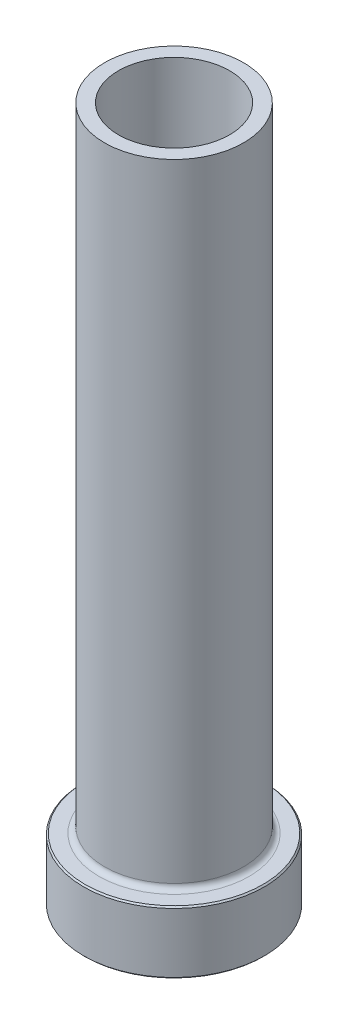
ISO-10303-21;
HEADER;
FILE_DESCRIPTION(('STEP AP214'),'2;1');
FILE_NAME('part.step','',(''),(''),'','','');
FILE_SCHEMA(('AUTOMOTIVE_DESIGN { 1 0 10303 214 1 1 1 1 }'));
ENDSEC;
DATA;
#1=APPLICATION_CONTEXT('core data for automotive mechanical design processes');
#2=APPLICATION_PROTOCOL_DEFINITION('international standard','automotive_design',2000,#1);
#3=PRODUCT_CONTEXT('',#1,'mechanical');
#4=PRODUCT('Part','Part','',(#3));
#5=PRODUCT_RELATED_PRODUCT_CATEGORY('part','',(#4));
#6=PRODUCT_DEFINITION_FORMATION('','',#4);
#7=PRODUCT_DEFINITION_CONTEXT('part definition',#1,'design');
#8=PRODUCT_DEFINITION('design','',#6,#7);
#9=PRODUCT_DEFINITION_SHAPE('','',#8);
#10=(LENGTH_UNIT() NAMED_UNIT(*) SI_UNIT(.MILLI.,.METRE.));
#11=(NAMED_UNIT(*) PLANE_ANGLE_UNIT() SI_UNIT($,.RADIAN.));
#12=(NAMED_UNIT(*) SI_UNIT($,.STERADIAN.) SOLID_ANGLE_UNIT());
#13=UNCERTAINTY_MEASURE_WITH_UNIT(LENGTH_MEASURE(1.E-05),#10,'distance_accuracy_value','');
#14=(GEOMETRIC_REPRESENTATION_CONTEXT(3) GLOBAL_UNCERTAINTY_ASSIGNED_CONTEXT((#13)) GLOBAL_UNIT_ASSIGNED_CONTEXT((#10,
#11,#12)) REPRESENTATION_CONTEXT('',''));
#15=CARTESIAN_POINT('',(0.,0.,0.));
#16=DIRECTION('',(0.,0.,1.));
#17=DIRECTION('',(1.,0.,0.));
#18=AXIS2_PLACEMENT_3D('',#15,#16,#17);
#19=CARTESIAN_POINT('',(0.,92.1876809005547,0.));
#20=DIRECTION('',(0.,1.,0.));
#21=DIRECTION('',(0.,0.,1.));
#22=AXIS2_PLACEMENT_3D('',#19,#20,#21);
#23=CYLINDRICAL_SURFACE('',#22,8.00000000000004);
#24=CARTESIAN_POINT('',(0.,100.,0.));
#25=DIRECTION('',(0.,1.,0.));
#26=DIRECTION('',(0.,0.,1.));
#27=AXIS2_PLACEMENT_3D('',#24,#25,#26);
#28=CIRCLE('',#27,8.00000000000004);
#29=CARTESIAN_POINT('',(0.,100.,8.00000000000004));
#30=VERTEX_POINT('',#29);
#31=EDGE_CURVE('E62',#30,#30,#28,.T.);
#32=ORIENTED_EDGE('',*,*,#31,.T.);
#33=EDGE_LOOP('',(#32));
#34=FACE_BOUND('',#33,.T.);
#35=CARTESIAN_POINT('',(0.,45.,0.));
#36=DIRECTION('',(0.,1.,0.));
#37=DIRECTION('',(0.,0.,1.));
#38=AXIS2_PLACEMENT_3D('',#35,#36,#37);
#39=CIRCLE('',#38,8.00000000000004);
#40=CARTESIAN_POINT('',(0.,45.,8.00000000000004));
#41=VERTEX_POINT('',#40);
#42=EDGE_CURVE('E71',#41,#41,#39,.T.);
#43=ORIENTED_EDGE('',*,*,#42,.F.);
#44=EDGE_LOOP('',(#43));
#45=FACE_BOUND('',#44,.T.);
#46=ADVANCED_FACE('F30',(#34,#45),#23,.F.);
#47=CARTESIAN_POINT('',(-8.00000000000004,100.,0.));
#48=DIRECTION('',(0.,1.,0.));
#49=DIRECTION('',(0.,0.,1.));
#50=AXIS2_PLACEMENT_3D('',#47,#48,#49);
#51=PLANE('',#50);
#52=CARTESIAN_POINT('',(0.,100.,0.));
#53=DIRECTION('',(0.,1.,0.));
#54=DIRECTION('',(0.,0.,1.));
#55=AXIS2_PLACEMENT_3D('',#52,#53,#54);
#56=CIRCLE('',#55,10.);
#57=CARTESIAN_POINT('',(0.,100.,10.));
#58=VERTEX_POINT('',#57);
#59=EDGE_CURVE('E65',#58,#58,#56,.T.);
#60=ORIENTED_EDGE('',*,*,#59,.T.);
#61=EDGE_LOOP('',(#60));
#62=FACE_BOUND('',#61,.T.);
#63=ORIENTED_EDGE('',*,*,#31,.F.);
#64=EDGE_LOOP('',(#63));
#65=FACE_BOUND('',#64,.T.);
#66=ADVANCED_FACE('F79',(#62,#65),#51,.T.);
#67=CARTESIAN_POINT('',(0.,92.1876809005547,0.));
#68=DIRECTION('',(0.,1.,0.));
#69=DIRECTION('',(0.,0.,1.));
#70=AXIS2_PLACEMENT_3D('',#67,#68,#69);
#71=CYLINDRICAL_SURFACE('',#70,9.99999999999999);
#72=CARTESIAN_POINT('',(0.,9.8,0.));
#73=DIRECTION('',(0.,1.,0.));
#74=DIRECTION('',(0.,0.,1.));
#75=AXIS2_PLACEMENT_3D('',#72,#73,#74);
#76=CIRCLE('',#75,9.99999999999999);
#77=CARTESIAN_POINT('',(0.,9.8,9.99999999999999));
#78=VERTEX_POINT('',#77);
#79=EDGE_CURVE('E59',#78,#78,#76,.T.);
#80=ORIENTED_EDGE('',*,*,#79,.T.);
#81=EDGE_LOOP('',(#80));
#82=FACE_BOUND('',#81,.T.);
#83=ORIENTED_EDGE('',*,*,#59,.F.);
#84=EDGE_LOOP('',(#83));
#85=FACE_BOUND('',#84,.T.);
#86=ADVANCED_FACE('F85',(#82,#85),#71,.T.);
#87=CARTESIAN_POINT('',(-9.99999999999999,9.,0.));
#88=DIRECTION('',(0.,1.,0.));
#89=DIRECTION('',(0.,0.,1.));
#90=AXIS2_PLACEMENT_3D('',#87,#88,#89);
#91=PLANE('',#90);
#92=CARTESIAN_POINT('',(0.,9.,0.));
#93=DIRECTION('',(0.,1.,0.));
#94=DIRECTION('',(0.,0.,1.));
#95=AXIS2_PLACEMENT_3D('',#92,#93,#94);
#96=CIRCLE('',#95,12.8);
#97=CARTESIAN_POINT('',(0.,9.,12.8));
#98=VERTEX_POINT('',#97);
#99=EDGE_CURVE('E53',#98,#98,#96,.T.);
#100=ORIENTED_EDGE('',*,*,#99,.T.);
#101=EDGE_LOOP('',(#100));
#102=FACE_BOUND('',#101,.T.);
#103=CARTESIAN_POINT('',(0.,9.,0.));
#104=DIRECTION('',(0.,1.,0.));
#105=DIRECTION('',(0.,0.,1.));
#106=AXIS2_PLACEMENT_3D('',#103,#104,#105);
#107=CIRCLE('',#106,10.8);
#108=CARTESIAN_POINT('',(0.,9.,10.8));
#109=VERTEX_POINT('',#108);
#110=EDGE_CURVE('E56',#109,#109,#107,.F.);
#111=ORIENTED_EDGE('',*,*,#110,.T.);
#112=EDGE_LOOP('',(#111));
#113=FACE_BOUND('',#112,.T.);
#114=ADVANCED_FACE('F111',(#102,#113),#91,.T.);
#115=CARTESIAN_POINT('',(0.,92.1876809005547,0.));
#116=DIRECTION('',(0.,1.,0.));
#117=DIRECTION('',(0.,0.,1.));
#118=AXIS2_PLACEMENT_3D('',#115,#116,#117);
#119=CYLINDRICAL_SURFACE('',#118,13.);
#120=CARTESIAN_POINT('',(0.,8.8,0.));
#121=DIRECTION('',(0.,1.,0.));
#122=DIRECTION('',(0.,0.,1.));
#123=AXIS2_PLACEMENT_3D('',#120,#121,#122);
#124=CIRCLE('',#123,13.);
#125=CARTESIAN_POINT('',(0.,8.8,13.));
#126=VERTEX_POINT('',#125);
#127=EDGE_CURVE('E45',#126,#126,#124,.F.);
#128=ORIENTED_EDGE('',*,*,#127,.T.);
#129=EDGE_LOOP('',(#128));
#130=FACE_BOUND('',#129,.T.);
#131=CARTESIAN_POINT('',(0.,0.199999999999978,0.));
#132=DIRECTION('',(0.,-1.,0.));
#133=DIRECTION('',(0.,0.,-1.));
#134=AXIS2_PLACEMENT_3D('',#131,#132,#133);
#135=CIRCLE('',#134,13.);
#136=CARTESIAN_POINT('',(0.,0.199999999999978,13.));
#137=VERTEX_POINT('',#136);
#138=EDGE_CURVE('E50',#137,#137,#135,.F.);
#139=ORIENTED_EDGE('',*,*,#138,.T.);
#140=EDGE_LOOP('',(#139));
#141=FACE_BOUND('',#140,.T.);
#142=ADVANCED_FACE('F108',(#130,#141),#119,.T.);
#143=CARTESIAN_POINT('',(-13.,0.,0.));
#144=DIRECTION('',(0.,-1.,0.));
#145=DIRECTION('',(0.,0.,-1.));
#146=AXIS2_PLACEMENT_3D('',#143,#144,#145);
#147=PLANE('',#146);
#148=CARTESIAN_POINT('',(0.,0.,0.));
#149=DIRECTION('',(0.,-1.,0.));
#150=DIRECTION('',(0.,0.,-1.));
#151=AXIS2_PLACEMENT_3D('',#148,#149,#150);
#152=CIRCLE('',#151,8.74999999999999);
#153=CARTESIAN_POINT('',(0.,0.,-8.74999999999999));
#154=VERTEX_POINT('',#153);
#155=EDGE_CURVE('E37',#154,#154,#152,.F.);
#156=ORIENTED_EDGE('',*,*,#155,.T.);
#157=EDGE_LOOP('',(#156));
#158=FACE_BOUND('',#157,.T.);
#159=CARTESIAN_POINT('',(0.,0.,0.));
#160=DIRECTION('',(0.,-1.,0.));
#161=DIRECTION('',(0.,0.,-1.));
#162=AXIS2_PLACEMENT_3D('',#159,#160,#161);
#163=CIRCLE('',#162,12.8);
#164=CARTESIAN_POINT('',(0.,0.,12.8));
#165=VERTEX_POINT('',#164);
#166=EDGE_CURVE('E41',#165,#165,#163,.T.);
#167=ORIENTED_EDGE('',*,*,#166,.T.);
#168=EDGE_LOOP('',(#167));
#169=FACE_BOUND('',#168,.T.);
#170=ADVANCED_FACE('F110',(#158,#169),#147,.T.);
#171=CARTESIAN_POINT('',(0.,92.1876809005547,0.));
#172=DIRECTION('',(0.,1.,0.));
#173=DIRECTION('',(0.,0.,1.));
#174=AXIS2_PLACEMENT_3D('',#171,#172,#173);
#175=CYLINDRICAL_SURFACE('',#174,8.24999999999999);
#176=CARTESIAN_POINT('',(0.,0.5,0.));
#177=DIRECTION('',(0.,-1.,0.));
#178=DIRECTION('',(0.,0.,-1.));
#179=AXIS2_PLACEMENT_3D('',#176,#177,#178);
#180=CIRCLE('',#179,8.24999999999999);
#181=CARTESIAN_POINT('',(0.,0.5,-8.24999999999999));
#182=VERTEX_POINT('',#181);
#183=EDGE_CURVE('E10',#182,#182,#180,.T.);
#184=ORIENTED_EDGE('',*,*,#183,.T.);
#185=EDGE_LOOP('',(#184));
#186=FACE_BOUND('',#185,.T.);
#187=CARTESIAN_POINT('',(0.,33.,0.));
#188=DIRECTION('',(0.,1.,0.));
#189=DIRECTION('',(0.,0.,1.));
#190=AXIS2_PLACEMENT_3D('',#187,#188,#189);
#191=CIRCLE('',#190,8.24999999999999);
#192=CARTESIAN_POINT('',(0.,33.,8.24999999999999));
#193=VERTEX_POINT('',#192);
#194=EDGE_CURVE('E68',#193,#193,#191,.T.);
#195=ORIENTED_EDGE('',*,*,#194,.T.);
#196=EDGE_LOOP('',(#195));
#197=FACE_BOUND('',#196,.T.);
#198=ADVANCED_FACE('F118',(#186,#197),#175,.F.);
#199=CARTESIAN_POINT('',(0.,33.,0.));
#200=DIRECTION('',(0.,-1.,0.));
#201=DIRECTION('',(0.,0.,-1.));
#202=AXIS2_PLACEMENT_3D('',#199,#200,#201);
#203=CONICAL_SURFACE('',#202,8.24999999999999,0.0208303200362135);
#204=ORIENTED_EDGE('',*,*,#42,.T.);
#205=EDGE_LOOP('',(#204));
#206=FACE_BOUND('',#205,.T.);
#207=ORIENTED_EDGE('',*,*,#194,.F.);
#208=EDGE_LOOP('',(#207));
#209=FACE_BOUND('',#208,.T.);
#210=ADVANCED_FACE('F75',(#206,#209),#203,.F.);
#211=CARTESIAN_POINT('',(0.,9.8,0.));
#212=DIRECTION('',(0.,1.,0.));
#213=DIRECTION('',(0.,0.,1.));
#214=AXIS2_PLACEMENT_3D('',#211,#212,#213);
#215=TOROIDAL_SURFACE('',#214,10.8,0.8);
#216=ORIENTED_EDGE('',*,*,#110,.F.);
#217=EDGE_LOOP('',(#216));
#218=FACE_BOUND('',#217,.T.);
#219=ORIENTED_EDGE('',*,*,#79,.F.);
#220=EDGE_LOOP('',(#219));
#221=FACE_BOUND('',#220,.T.);
#222=ADVANCED_FACE('F90',(#218,#221),#215,.F.);
#223=CARTESIAN_POINT('',(0.,8.99999999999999,0.));
#224=DIRECTION('',(0.,-1.,0.));
#225=DIRECTION('',(0.,0.,-1.));
#226=AXIS2_PLACEMENT_3D('',#223,#224,#225);
#227=CONICAL_SURFACE('',#226,12.8,0.785398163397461);
#228=ORIENTED_EDGE('',*,*,#127,.F.);
#229=EDGE_LOOP('',(#228));
#230=FACE_BOUND('',#229,.T.);
#231=ORIENTED_EDGE('',*,*,#99,.F.);
#232=EDGE_LOOP('',(#231));
#233=FACE_BOUND('',#232,.T.);
#234=ADVANCED_FACE('F93',(#230,#233),#227,.T.);
#235=CARTESIAN_POINT('',(0.,0.199999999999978,0.));
#236=DIRECTION('',(0.,1.,0.));
#237=DIRECTION('',(0.,0.,1.));
#238=AXIS2_PLACEMENT_3D('',#235,#236,#237);
#239=CONICAL_SURFACE('',#238,13.,0.785398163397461);
#240=CARTESIAN_POINT('',(0.,0.,12.8));
#241=CARTESIAN_POINT('',(0.,0.00208333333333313,12.8020833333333));
#242=CARTESIAN_POINT('',(0.,0.00416666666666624,12.8041666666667));
#243=CARTESIAN_POINT('',(0.,0.00833333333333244,12.8083333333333));
#244=CARTESIAN_POINT('',(0.,0.0104166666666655,12.8104166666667));
#245=CARTESIAN_POINT('',(0.,0.0145833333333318,12.8145833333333));
#246=CARTESIAN_POINT('',(0.,0.0166666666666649,12.8166666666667));
#247=CARTESIAN_POINT('',(0.,0.0208333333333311,12.8208333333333));
#248=CARTESIAN_POINT('',(0.,0.0229166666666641,12.8229166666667));
#249=CARTESIAN_POINT('',(0.,0.0270833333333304,12.8270833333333));
#250=CARTESIAN_POINT('',(0.,0.0291666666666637,12.8291666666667));
#251=CARTESIAN_POINT('',(0.,0.0333333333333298,12.8333333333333));
#252=CARTESIAN_POINT('',(0.,0.0354166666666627,12.8354166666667));
#253=CARTESIAN_POINT('',(0.,0.0395833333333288,12.8395833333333));
#254=CARTESIAN_POINT('',(0.,0.0416666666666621,12.8416666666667));
#255=CARTESIAN_POINT('',(0.,0.0458333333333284,12.8458333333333));
#256=CARTESIAN_POINT('',(0.,0.0479166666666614,12.8479166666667));
#257=CARTESIAN_POINT('',(0.,0.0520833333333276,12.8520833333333));
#258=CARTESIAN_POINT('',(0.,0.0541666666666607,12.8541666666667));
#259=CARTESIAN_POINT('',(0.,0.0583333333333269,12.8583333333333));
#260=CARTESIAN_POINT('',(0.,0.06041666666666,12.8604166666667));
#261=CARTESIAN_POINT('',(0.,0.0645833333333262,12.8645833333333));
#262=CARTESIAN_POINT('',(0.,0.0666666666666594,12.8666666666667));
#263=CARTESIAN_POINT('',(0.,0.0708333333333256,12.8708333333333));
#264=CARTESIAN_POINT('',(0.,0.0729166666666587,12.8729166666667));
#265=CARTESIAN_POINT('',(0.,0.0770833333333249,12.8770833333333));
#266=CARTESIAN_POINT('',(0.,0.079166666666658,12.8791666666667));
#267=CARTESIAN_POINT('',(0.,0.0833333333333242,12.8833333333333));
#268=CARTESIAN_POINT('',(0.,0.0854166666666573,12.8854166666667));
#269=CARTESIAN_POINT('',(0.,0.0895833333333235,12.8895833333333));
#270=CARTESIAN_POINT('',(0.,0.0916666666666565,12.8916666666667));
#271=CARTESIAN_POINT('',(0.,0.0958333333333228,12.8958333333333));
#272=CARTESIAN_POINT('',(0.,0.0979166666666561,12.8979166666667));
#273=CARTESIAN_POINT('',(0.,0.102083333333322,12.9020833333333));
#274=CARTESIAN_POINT('',(0.,0.104166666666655,12.9041666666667));
#275=CARTESIAN_POINT('',(0.,0.108333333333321,12.9083333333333));
#276=CARTESIAN_POINT('',(0.,0.110416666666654,12.9104166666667));
#277=CARTESIAN_POINT('',(0.,0.114583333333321,12.9145833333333));
#278=CARTESIAN_POINT('',(0.,0.116666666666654,12.9166666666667));
#279=CARTESIAN_POINT('',(0.,0.12083333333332,12.9208333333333));
#280=CARTESIAN_POINT('',(0.,0.122916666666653,12.9229166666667));
#281=CARTESIAN_POINT('',(0.,0.127083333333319,12.9270833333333));
#282=CARTESIAN_POINT('',(0.,0.129166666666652,12.9291666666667));
#283=CARTESIAN_POINT('',(0.,0.133333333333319,12.9333333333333));
#284=CARTESIAN_POINT('',(0.,0.135416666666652,12.9354166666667));
#285=CARTESIAN_POINT('',(0.,0.139583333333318,12.9395833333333));
#286=CARTESIAN_POINT('',(0.,0.141666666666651,12.9416666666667));
#287=CARTESIAN_POINT('',(0.,0.145833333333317,12.9458333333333));
#288=CARTESIAN_POINT('',(0.,0.14791666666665,12.9479166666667));
#289=CARTESIAN_POINT('',(0.,0.152083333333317,12.9520833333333));
#290=CARTESIAN_POINT('',(0.,0.15416666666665,12.9541666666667));
#291=CARTESIAN_POINT('',(0.,0.158333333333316,12.9583333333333));
#292=CARTESIAN_POINT('',(0.,0.160416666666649,12.9604166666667));
#293=CARTESIAN_POINT('',(0.,0.164583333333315,12.9645833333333));
#294=CARTESIAN_POINT('',(0.,0.166666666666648,12.9666666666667));
#295=CARTESIAN_POINT('',(0.,0.170833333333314,12.9708333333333));
#296=CARTESIAN_POINT('',(0.,0.172916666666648,12.9729166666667));
#297=CARTESIAN_POINT('',(0.,0.177083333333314,12.9770833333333));
#298=CARTESIAN_POINT('',(0.,0.179166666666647,12.9791666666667));
#299=CARTESIAN_POINT('',(0.,0.183333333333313,12.9833333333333));
#300=CARTESIAN_POINT('',(0.,0.185416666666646,12.9854166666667));
#301=CARTESIAN_POINT('',(0.,0.189583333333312,12.9895833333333));
#302=CARTESIAN_POINT('',(0.,0.191666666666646,12.9916666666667));
#303=CARTESIAN_POINT('',(0.,0.195833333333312,12.9958333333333));
#304=CARTESIAN_POINT('',(0.,0.197916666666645,12.9979166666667));
#305=CARTESIAN_POINT('',(0.,0.199999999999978,13.));
#306=B_SPLINE_CURVE_WITH_KNOTS('',3,(#240,#241,#242,#243,#244,#245,#246,#247,#248,#249,#250,
#251,#252,#253,#254,#255,#256,#257,#258,#259,#260,#261,#262,#263,#264,#265,#266,#267,#268,#269,
#270,#271,#272,#273,#274,#275,#276,#277,#278,#279,#280,#281,#282,#283,#284,#285,#286,#287,#288,
#289,#290,#291,#292,#293,#294,#295,#296,#297,#298,#299,#300,#301,#302,#303,#304,#305),
.UNSPECIFIED.,.F.,.F.,(4,2,2,2,2,2,2,2,2,2,2,2,2,2,2,2,2,2,2,2,2,2,2,2,2,2,2,2,2,2,2,2,4),(0.,
0.00883883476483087,0.0176776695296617,0.0265165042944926,0.0353553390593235,0.0441941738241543,
0.0530330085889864,0.0618718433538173,0.0707106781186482,0.079549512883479,0.0883883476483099,
0.0972271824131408,0.106066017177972,0.114904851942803,0.123743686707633,0.132582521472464,
0.141421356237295,0.150260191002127,0.159099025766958,0.167937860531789,0.17677669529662,
0.185615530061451,0.194454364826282,0.203293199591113,0.212132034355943,0.220970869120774,
0.229809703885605,0.238648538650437,0.247487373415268,0.256326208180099,0.26516504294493,
0.274003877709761,0.282842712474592),.UNSPECIFIED.);
#307=EDGE_CURVE('BSEAM96',#165,#137,#306,.T.);
#308=ORIENTED_EDGE('',*,*,#166,.F.);
#309=ORIENTED_EDGE('',*,*,#138,.F.);
#310=ORIENTED_EDGE('',*,*,#307,.T.);
#311=ORIENTED_EDGE('',*,*,#307,.F.);
#312=EDGE_LOOP('',(#308,#310,#309,#311));
#313=FACE_BOUND('',#312,.T.);
#314=ADVANCED_FACE('F96',(#313),#239,.T.);
#315=CARTESIAN_POINT('',(0.,0.,0.));
#316=DIRECTION('',(0.,-1.,0.));
#317=DIRECTION('',(0.,0.,-1.));
#318=AXIS2_PLACEMENT_3D('',#315,#316,#317);
#319=CONICAL_SURFACE('',#318,8.74999999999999,0.78539816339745);
#320=ORIENTED_EDGE('',*,*,#183,.F.);
#321=EDGE_LOOP('',(#320));
#322=FACE_BOUND('',#321,.T.);
#323=ORIENTED_EDGE('',*,*,#155,.F.);
#324=EDGE_LOOP('',(#323));
#325=FACE_BOUND('',#324,.T.);
#326=ADVANCED_FACE('F32',(#322,#325),#319,.F.);
#327=CLOSED_SHELL('',(#46,#66,#86,#114,#142,#170,#198,#210,#222,#234,#314,#326));
#328=MANIFOLD_SOLID_BREP('B2',#327);
#329=ADVANCED_BREP_SHAPE_REPRESENTATION('',(#18,#328),#14);
#330=SHAPE_DEFINITION_REPRESENTATION(#9,#329);
ENDSEC;
END-ISO-10303-21;
